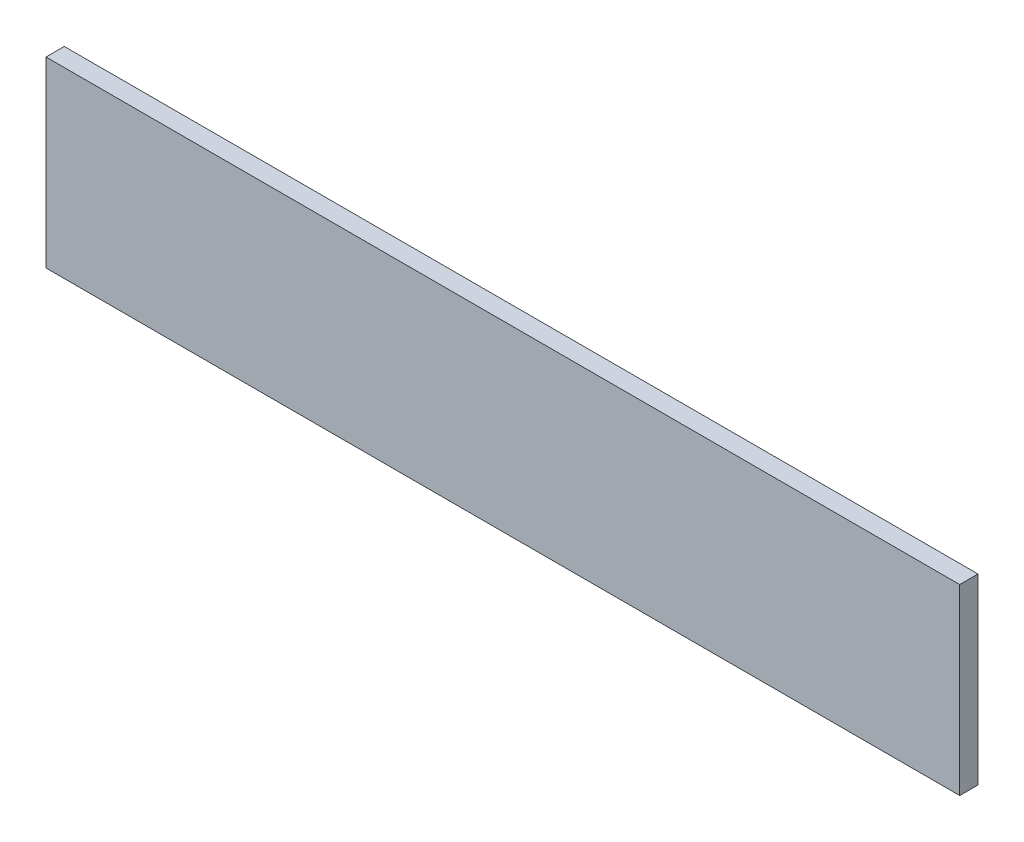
from build123d import *

# Parameters (mm, degrees)
ESQUISSE1_W      = 500
ESQUISSE1_H      = 100
EXTRUSION1_DEPTH = 10


with BuildPart() as part:
    # Esquisse1 → Extrusion1 (new body)
    with BuildSketch(Plane.XY):
        with Locations((249.151049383, -50)):
            Rectangle(ESQUISSE1_W, ESQUISSE1_H)
    extrude(amount=EXTRUSION1_DEPTH)


solid = part.part
